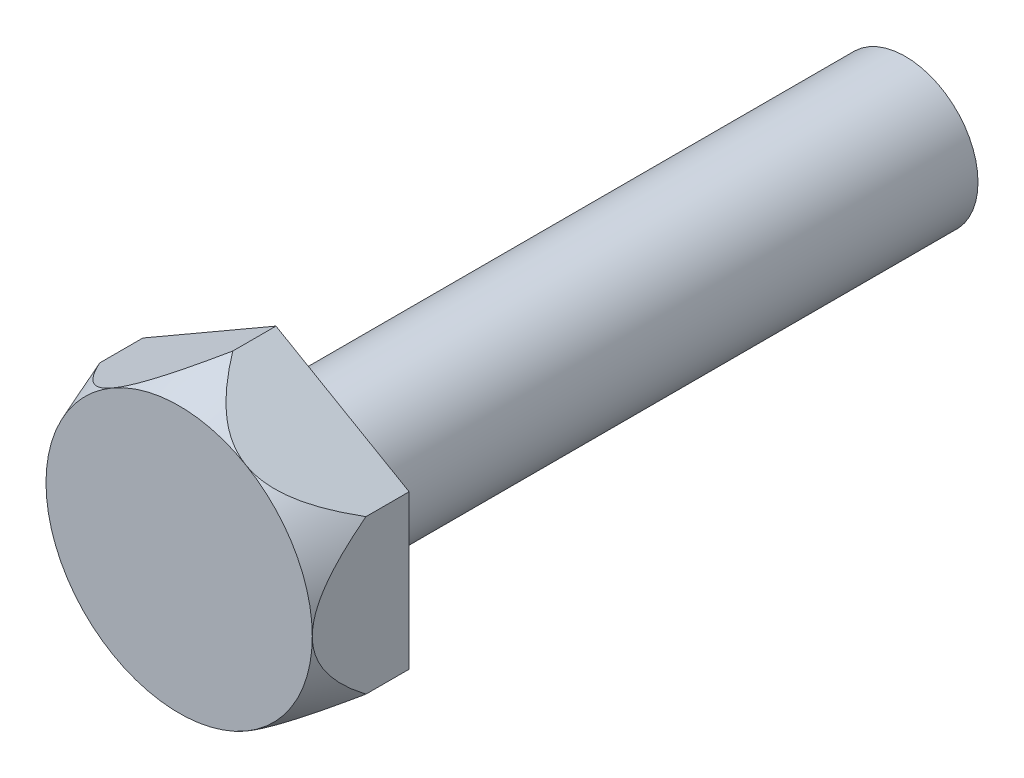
ISO-10303-21;
HEADER;
FILE_DESCRIPTION(('STEP AP214'),'2;1');
FILE_NAME('part.step','',(''),(''),'','','');
FILE_SCHEMA(('AUTOMOTIVE_DESIGN { 1 0 10303 214 1 1 1 1 }'));
ENDSEC;
DATA;
#1=APPLICATION_CONTEXT('core data for automotive mechanical design processes');
#2=APPLICATION_PROTOCOL_DEFINITION('international standard','automotive_design',2000,#1);
#3=PRODUCT_CONTEXT('',#1,'mechanical');
#4=PRODUCT('Part','Part','',(#3));
#5=PRODUCT_RELATED_PRODUCT_CATEGORY('part','',(#4));
#6=PRODUCT_DEFINITION_FORMATION('','',#4);
#7=PRODUCT_DEFINITION_CONTEXT('part definition',#1,'design');
#8=PRODUCT_DEFINITION('design','',#6,#7);
#9=PRODUCT_DEFINITION_SHAPE('','',#8);
#10=(LENGTH_UNIT() NAMED_UNIT(*) SI_UNIT(.MILLI.,.METRE.));
#11=(NAMED_UNIT(*) PLANE_ANGLE_UNIT() SI_UNIT($,.RADIAN.));
#12=(NAMED_UNIT(*) SI_UNIT($,.STERADIAN.) SOLID_ANGLE_UNIT());
#13=UNCERTAINTY_MEASURE_WITH_UNIT(LENGTH_MEASURE(1.E-05),#10,'distance_accuracy_value','');
#14=(GEOMETRIC_REPRESENTATION_CONTEXT(3) GLOBAL_UNCERTAINTY_ASSIGNED_CONTEXT((#13)) GLOBAL_UNIT_ASSIGNED_CONTEXT((#10,
#11,#12)) REPRESENTATION_CONTEXT('',''));
#15=CARTESIAN_POINT('',(0.,0.,0.));
#16=DIRECTION('',(0.,0.,1.));
#17=DIRECTION('',(1.,0.,0.));
#18=AXIS2_PLACEMENT_3D('',#15,#16,#17);
#19=CARTESIAN_POINT('',(0.,3.17542648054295,0.));
#20=DIRECTION('',(0.,0.,1.));
#21=DIRECTION('',(1.,0.,0.));
#22=AXIS2_PLACEMENT_3D('',#19,#20,#21);
#23=PLANE('',#22);
#24=DIRECTION('',(-0.866025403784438,0.5,0.));
#25=VECTOR('',#24,1.);
#26=CARTESIAN_POINT('',(2.75,1.58771324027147,0.));
#27=LINE('',#26,#25);
#28=CARTESIAN_POINT('',(2.75,1.58771324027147,0.));
#29=VERTEX_POINT('',#28);
#30=CARTESIAN_POINT('',(0.,3.17542648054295,0.));
#31=VERTEX_POINT('',#30);
#32=EDGE_CURVE('E114',#29,#31,#27,.T.);
#33=ORIENTED_EDGE('',*,*,#32,.F.);
#34=DIRECTION('',(0.,1.,0.));
#35=VECTOR('',#34,1.);
#36=CARTESIAN_POINT('',(2.75,-1.58771324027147,0.));
#37=LINE('',#36,#35);
#38=CARTESIAN_POINT('',(2.75,-1.58771324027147,0.));
#39=VERTEX_POINT('',#38);
#40=EDGE_CURVE('E261',#39,#29,#37,.T.);
#41=ORIENTED_EDGE('',*,*,#40,.F.);
#42=DIRECTION('',(0.866025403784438,0.5,0.));
#43=VECTOR('',#42,1.);
#44=CARTESIAN_POINT('',(0.,-3.17542648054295,0.));
#45=LINE('',#44,#43);
#46=CARTESIAN_POINT('',(0.,-3.17542648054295,0.));
#47=VERTEX_POINT('',#46);
#48=EDGE_CURVE('E259',#47,#39,#45,.T.);
#49=ORIENTED_EDGE('',*,*,#48,.F.);
#50=DIRECTION('',(0.866025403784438,-0.500000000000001,0.));
#51=VECTOR('',#50,1.);
#52=CARTESIAN_POINT('',(-2.75,-1.58771324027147,0.));
#53=LINE('',#52,#51);
#54=CARTESIAN_POINT('',(-2.75,-1.58771324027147,0.));
#55=VERTEX_POINT('',#54);
#56=EDGE_CURVE('E224',#55,#47,#53,.T.);
#57=ORIENTED_EDGE('',*,*,#56,.F.);
#58=DIRECTION('',(0.,-1.,0.));
#59=VECTOR('',#58,1.);
#60=CARTESIAN_POINT('',(-2.75,1.58771324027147,0.));
#61=LINE('',#60,#59);
#62=CARTESIAN_POINT('',(-2.75,1.58771324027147,0.));
#63=VERTEX_POINT('',#62);
#64=EDGE_CURVE('E267',#63,#55,#61,.T.);
#65=ORIENTED_EDGE('',*,*,#64,.F.);
#66=DIRECTION('',(-0.866025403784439,-0.5,0.));
#67=VECTOR('',#66,1.);
#68=CARTESIAN_POINT('',(0.,3.17542648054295,0.));
#69=LINE('',#68,#67);
#70=EDGE_CURVE('E268',#31,#63,#69,.T.);
#71=ORIENTED_EDGE('',*,*,#70,.F.);
#72=EDGE_LOOP('',(#33,#41,#49,#57,#65,#71));
#73=FACE_BOUND('',#72,.T.);
#74=CARTESIAN_POINT('',(0.,0.,0.));
#75=DIRECTION('',(0.,0.,1.));
#76=DIRECTION('',(1.,0.,0.));
#77=AXIS2_PLACEMENT_3D('',#74,#75,#76);
#78=CIRCLE('',#77,1.5);
#79=CARTESIAN_POINT('',(1.5,0.,0.));
#80=VERTEX_POINT('',#79);
#81=EDGE_CURVE('E12',#80,#80,#78,.F.);
#82=ORIENTED_EDGE('',*,*,#81,.F.);
#83=EDGE_LOOP('',(#82));
#84=FACE_BOUND('',#83,.T.);
#85=ADVANCED_FACE('F32',(#73,#84),#23,.F.);
#86=CARTESIAN_POINT('',(2.75,1.58771324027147,2.));
#87=DIRECTION('',(-0.5,-0.866025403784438,0.));
#88=DIRECTION('',(0.866025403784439,-0.5,0.));
#89=AXIS2_PLACEMENT_3D('',#86,#87,#88);
#90=PLANE('',#89);
#91=CARTESIAN_POINT('',(2.7502,1.58759777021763,0.891425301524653));
#92=CARTESIAN_POINT('',(2.72483006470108,1.60224510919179,0.929582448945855));
#93=CARTESIAN_POINT('',(2.69913335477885,1.61708111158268,0.967449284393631));
#94=CARTESIAN_POINT('',(2.64699514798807,1.6471831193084,1.04250909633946));
#95=CARTESIAN_POINT('',(2.62055345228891,1.66244923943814,1.07970188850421));
#96=CARTESIAN_POINT('',(2.53960450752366,1.70918513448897,1.19063332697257));
#97=CARTESIAN_POINT('',(2.48383960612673,1.74138101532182,1.26316734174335));
#98=CARTESIAN_POINT('',(2.36594902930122,1.80944517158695,1.40634953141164));
#99=CARTESIAN_POINT('',(2.30366274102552,1.84540617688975,1.47682328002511));
#100=CARTESIAN_POINT('',(2.17353357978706,1.9205362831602,1.61025791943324));
#101=CARTESIAN_POINT('',(2.10571002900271,1.95969422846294,1.67324319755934));
#102=CARTESIAN_POINT('',(1.98089614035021,2.03175556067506,1.77341193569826));
#103=CARTESIAN_POINT('',(1.92544181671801,2.06377212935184,1.81310794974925));
#104=CARTESIAN_POINT('',(1.81058167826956,2.13008666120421,1.88310916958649));
#105=CARTESIAN_POINT('',(1.75120455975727,2.16436805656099,1.91347500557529));
#106=CARTESIAN_POINT('',(1.63865889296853,2.22934632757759,1.95785084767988));
#107=CARTESIAN_POINT('',(1.58605175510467,2.25971907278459,1.97371800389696));
#108=CARTESIAN_POINT('',(1.47923620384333,2.32138906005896,1.99492688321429));
#109=CARTESIAN_POINT('',(1.42502856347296,2.35268585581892,2.00027360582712));
#110=CARTESIAN_POINT('',(1.31656477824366,2.41530745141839,1.99970408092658));
#111=CARTESIAN_POINT('',(1.26230871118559,2.44663220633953,1.99376837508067));
#112=CARTESIAN_POINT('',(1.15547805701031,2.50831091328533,1.97142393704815));
#113=CARTESIAN_POINT('',(1.10290430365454,2.5386643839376,1.95501009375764));
#114=CARTESIAN_POINT('',(0.979797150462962,2.60974033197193,1.90519724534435));
#115=CARTESIAN_POINT('',(0.910554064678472,2.64971784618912,1.86762057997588));
#116=CARTESIAN_POINT('',(0.777415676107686,2.72658533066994,1.7805417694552));
#117=CARTESIAN_POINT('',(0.713573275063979,2.76344475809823,1.73093676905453));
#118=CARTESIAN_POINT('',(0.588298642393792,2.835772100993,1.62150854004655));
#119=CARTESIAN_POINT('',(0.527109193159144,2.87109984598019,1.56132241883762));
#120=CARTESIAN_POINT('',(0.409235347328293,2.93915434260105,1.43514951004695));
#121=CARTESIAN_POINT('',(0.352561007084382,2.97187528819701,1.36915042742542));
#122=CARTESIAN_POINT('',(0.244947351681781,3.03400606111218,1.23574606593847));
#123=CARTESIAN_POINT('',(0.19387327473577,3.06349369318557,1.16848379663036));
#124=CARTESIAN_POINT('',(0.0947809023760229,3.12070470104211,1.03157863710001));
#125=CARTESIAN_POINT('',(0.0467486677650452,3.14843612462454,0.961949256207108));
#126=CARTESIAN_POINT('',(-0.000200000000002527,3.17554195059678,0.891425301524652));
#127=B_SPLINE_CURVE_WITH_KNOTS('',3,(#91,#92,#93,#94,#95,#96,#97,#98,#99,#100,#101,#102,#103,
#104,#105,#106,#107,#108,#109,#110,#111,#112,#113,#114,#115,#116,#117,#118,#119,#120,#121,#122,
#123,#124,#125,#126),.UNSPECIFIED.,.F.,.F.,(4,2,2,2,2,2,2,2,2,2,2,2,2,2,2,2,2,4),(0.,
0.144311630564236,0.288662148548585,0.579460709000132,0.88123179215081,1.18199150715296,
1.4074916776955,1.63149388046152,1.81905509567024,2.00652715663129,2.19432283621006,
2.38221019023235,2.64573604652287,2.91160014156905,3.1895917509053,3.4681861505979,
3.73644479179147,4.00336876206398),.UNSPECIFIED.);
#128=CARTESIAN_POINT('',(2.75,1.5877132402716,0.891726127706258));
#129=VERTEX_POINT('',#128);
#130=CARTESIAN_POINT('',(1.375,2.38156986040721,2.));
#131=VERTEX_POINT('',#130);
#132=EDGE_CURVE('E107',#129,#131,#127,.T.);
#133=ORIENTED_EDGE('',*,*,#132,.F.);
#134=DIRECTION('',(0.,0.,-1.));
#135=VECTOR('',#134,1.);
#136=CARTESIAN_POINT('',(2.75,1.58771324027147,2.));
#137=LINE('',#136,#135);
#138=EDGE_CURVE('E56',#129,#29,#137,.T.);
#139=ORIENTED_EDGE('',*,*,#138,.T.);
#140=ORIENTED_EDGE('',*,*,#32,.T.);
#141=DIRECTION('',(0.,0.,-1.));
#142=VECTOR('',#141,1.);
#143=CARTESIAN_POINT('',(0.,3.17542648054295,2.));
#144=LINE('',#143,#142);
#145=CARTESIAN_POINT('',(0.,3.17542648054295,0.89172612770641));
#146=VERTEX_POINT('',#145);
#147=EDGE_CURVE('E130',#146,#31,#144,.T.);
#148=ORIENTED_EDGE('',*,*,#147,.F.);
#149=EDGE_CURVE('E115',#131,#146,#127,.T.);
#150=ORIENTED_EDGE('',*,*,#149,.F.);
#151=EDGE_LOOP('',(#133,#139,#140,#148,#150));
#152=FACE_BOUND('',#151,.T.);
#153=ADVANCED_FACE('F34',(#152),#90,.F.);
#154=CARTESIAN_POINT('',(0.,3.17542648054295,2.));
#155=DIRECTION('',(0.5,-0.866025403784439,0.));
#156=DIRECTION('',(0.866025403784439,0.5,0.));
#157=AXIS2_PLACEMENT_3D('',#154,#155,#156);
#158=PLANE('',#157);
#159=CARTESIAN_POINT('',(0.000199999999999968,3.17554195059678,0.891425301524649));
#160=CARTESIAN_POINT('',(-0.0251699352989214,3.16089461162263,0.92958244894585));
#161=CARTESIAN_POINT('',(-0.0508666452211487,3.14605860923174,0.967449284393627));
#162=CARTESIAN_POINT('',(-0.103004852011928,3.11595660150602,1.04250909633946));
#163=CARTESIAN_POINT('',(-0.129446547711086,3.10069048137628,1.0797018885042));
#164=CARTESIAN_POINT('',(-0.210395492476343,3.05395458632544,1.19063332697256));
#165=CARTESIAN_POINT('',(-0.266160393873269,3.0217587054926,1.26316734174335));
#166=CARTESIAN_POINT('',(-0.384050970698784,2.95369454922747,1.40634953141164));
#167=CARTESIAN_POINT('',(-0.44633725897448,2.91773354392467,1.4768232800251));
#168=CARTESIAN_POINT('',(-0.576466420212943,2.84260343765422,1.61025791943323));
#169=CARTESIAN_POINT('',(-0.644289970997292,2.80344549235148,1.67324319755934));
#170=CARTESIAN_POINT('',(-0.769103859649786,2.73138416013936,1.77341193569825));
#171=CARTESIAN_POINT('',(-0.824558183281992,2.69936759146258,1.81310794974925));
#172=CARTESIAN_POINT('',(-0.939418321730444,2.63305305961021,1.88310916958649));
#173=CARTESIAN_POINT('',(-0.998795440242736,2.59877166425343,1.91347500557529));
#174=CARTESIAN_POINT('',(-1.11134110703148,2.53379339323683,1.95785084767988));
#175=CARTESIAN_POINT('',(-1.16394824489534,2.50342064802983,1.97371800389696));
#176=CARTESIAN_POINT('',(-1.27076379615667,2.44175066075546,1.99492688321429));
#177=CARTESIAN_POINT('',(-1.32497143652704,2.4104538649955,2.00027360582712));
#178=CARTESIAN_POINT('',(-1.43343522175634,2.34783226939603,1.99970408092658));
#179=CARTESIAN_POINT('',(-1.48769128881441,2.31650751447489,1.99376837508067));
#180=CARTESIAN_POINT('',(-1.59452194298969,2.25482880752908,1.97142393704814));
#181=CARTESIAN_POINT('',(-1.64709569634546,2.22447533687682,1.95501009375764));
#182=CARTESIAN_POINT('',(-1.77020284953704,2.15339938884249,1.90519724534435));
#183=CARTESIAN_POINT('',(-1.83944593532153,2.1134218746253,1.86762057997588));
#184=CARTESIAN_POINT('',(-1.97258432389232,2.03655439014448,1.78054176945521));
#185=CARTESIAN_POINT('',(-2.03642672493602,1.99969496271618,1.73093676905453));
#186=CARTESIAN_POINT('',(-2.16170135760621,1.92736761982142,1.62150854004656));
#187=CARTESIAN_POINT('',(-2.22289080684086,1.89203987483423,1.56132241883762));
#188=CARTESIAN_POINT('',(-2.34076465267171,1.82398537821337,1.43514951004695));
#189=CARTESIAN_POINT('',(-2.39743899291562,1.79126443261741,1.36915042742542));
#190=CARTESIAN_POINT('',(-2.50505264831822,1.72913365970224,1.23574606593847));
#191=CARTESIAN_POINT('',(-2.55612672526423,1.69964602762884,1.16848379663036));
#192=CARTESIAN_POINT('',(-2.65521909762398,1.64243501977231,1.03157863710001));
#193=CARTESIAN_POINT('',(-2.70325133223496,1.61470359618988,0.961949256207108));
#194=CARTESIAN_POINT('',(-2.75020000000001,1.58759777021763,0.891425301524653));
#195=B_SPLINE_CURVE_WITH_KNOTS('',3,(#159,#160,#161,#162,#163,#164,#165,#166,#167,#168,#169,
#170,#171,#172,#173,#174,#175,#176,#177,#178,#179,#180,#181,#182,#183,#184,#185,#186,#187,#188,
#189,#190,#191,#192,#193,#194),.UNSPECIFIED.,.F.,.F.,(4,2,2,2,2,2,2,2,2,2,2,2,2,2,2,2,2,4),(0.,
0.144311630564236,0.288662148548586,0.579460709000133,0.881231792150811,1.18199150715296,
1.40749167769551,1.63149388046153,1.81905509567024,2.00652715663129,2.19432283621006,
2.38221019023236,2.64573604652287,2.91160014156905,3.1895917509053,3.46818615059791,
3.73644479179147,4.00336876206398),.UNSPECIFIED.);
#196=CARTESIAN_POINT('',(-1.375,2.38156986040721,2.));
#197=VERTEX_POINT('',#196);
#198=EDGE_CURVE('E121',#146,#197,#195,.T.);
#199=ORIENTED_EDGE('',*,*,#198,.F.);
#200=ORIENTED_EDGE('',*,*,#147,.T.);
#201=ORIENTED_EDGE('',*,*,#70,.T.);
#202=DIRECTION('',(0.,0.,-1.));
#203=VECTOR('',#202,1.);
#204=CARTESIAN_POINT('',(-2.75,1.58771324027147,2.));
#205=LINE('',#204,#203);
#206=CARTESIAN_POINT('',(-2.75,1.5877132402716,0.891726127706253));
#207=VERTEX_POINT('',#206);
#208=EDGE_CURVE('E229',#207,#63,#205,.T.);
#209=ORIENTED_EDGE('',*,*,#208,.F.);
#210=EDGE_CURVE('E131',#197,#207,#195,.T.);
#211=ORIENTED_EDGE('',*,*,#210,.F.);
#212=EDGE_LOOP('',(#199,#200,#201,#209,#211));
#213=FACE_BOUND('',#212,.T.);
#214=ADVANCED_FACE('F184',(#213),#158,.F.);
#215=CARTESIAN_POINT('',(-2.75,1.58771324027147,2.));
#216=DIRECTION('',(1.,0.,0.));
#217=DIRECTION('',(0.,1.,0.));
#218=AXIS2_PLACEMENT_3D('',#215,#216,#217);
#219=PLANE('',#218);
#220=CARTESIAN_POINT('',(-2.75,-3.89015134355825,-3.24667165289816));
#221=CARTESIAN_POINT('',(-2.75,-3.81148641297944,-3.0793665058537));
#222=CARTESIAN_POINT('',(-2.75,-3.73219430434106,-2.91235273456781));
#223=CARTESIAN_POINT('',(-2.75,-3.57204223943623,-2.57904413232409));
#224=CARTESIAN_POINT('',(-2.75,-3.49118201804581,-2.41274942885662));
#225=CARTESIAN_POINT('',(-2.75,-3.32699699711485,-2.07983572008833));
#226=CARTESIAN_POINT('',(-2.75,-3.24365831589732,-1.91322354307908));
#227=CARTESIAN_POINT('',(-2.75,-3.07467896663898,-1.5811911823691));
#228=CARTESIAN_POINT('',(-2.75,-2.98903854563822,-1.41577087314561));
#229=CARTESIAN_POINT('',(-2.75,-2.80402688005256,-1.06591966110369));
#230=CARTESIAN_POINT('',(-2.75,-2.70427465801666,-0.88168909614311));
#231=CARTESIAN_POINT('',(-2.75,-2.49994153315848,-0.515828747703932));
#232=CARTESIAN_POINT('',(-2.75,-2.39535891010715,-0.334199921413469));
#233=CARTESIAN_POINT('',(-2.75,-2.18004388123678,0.0245459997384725));
#234=CARTESIAN_POINT('',(-2.75,-2.06933500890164,0.201677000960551));
#235=CARTESIAN_POINT('',(-2.75,-1.89632370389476,0.462699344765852));
#236=CARTESIAN_POINT('',(-2.75,-1.83751429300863,0.548902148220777));
#237=CARTESIAN_POINT('',(-2.75,-1.71703151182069,0.7192753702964));
#238=CARTESIAN_POINT('',(-2.75,-1.65535859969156,0.803446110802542));
#239=CARTESIAN_POINT('',(-2.75,-1.53156539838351,0.965011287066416));
#240=CARTESIAN_POINT('',(-2.75,-1.46961558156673,1.04253555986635));
#241=CARTESIAN_POINT('',(-2.75,-1.34162548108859,1.19429417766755));
#242=CARTESIAN_POINT('',(-2.75,-1.27558137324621,1.26852533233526));
#243=CARTESIAN_POINT('',(-2.75,-1.13932807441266,1.41118499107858));
#244=CARTESIAN_POINT('',(-2.75,-1.06918824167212,1.47967899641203));
#245=CARTESIAN_POINT('',(-2.75,-0.922719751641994,1.60960918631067));
#246=CARTESIAN_POINT('',(-2.75,-0.846402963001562,1.67105838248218));
#247=CARTESIAN_POINT('',(-2.75,-0.704570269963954,1.77022187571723));
#248=CARTESIAN_POINT('',(-2.75,-0.640620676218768,1.81014203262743));
#249=CARTESIAN_POINT('',(-2.75,-0.50780627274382,1.88084376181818));
#250=CARTESIAN_POINT('',(-2.75,-0.438948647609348,1.91163836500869));
#251=CARTESIAN_POINT('',(-2.75,-0.308634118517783,1.9566429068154));
#252=CARTESIAN_POINT('',(-2.75,-0.247850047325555,1.97275892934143));
#253=CARTESIAN_POINT('',(-2.75,-0.124399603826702,1.99446160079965));
#254=CARTESIAN_POINT('',(-2.75,-0.0617344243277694,2.00005478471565));
#255=CARTESIAN_POINT('',(-2.75,0.0637100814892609,1.99994429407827));
#256=CARTESIAN_POINT('',(-2.75,0.126489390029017,1.99421838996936));
#257=CARTESIAN_POINT('',(-2.75,0.250127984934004,1.9722293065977));
#258=CARTESIAN_POINT('',(-2.75,0.310986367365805,1.95596124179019));
#259=CARTESIAN_POINT('',(-2.75,0.453257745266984,1.90650703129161));
#260=CARTESIAN_POINT('',(-2.75,0.533199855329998,1.86916279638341));
#261=CARTESIAN_POINT('',(-2.75,0.686505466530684,1.78274370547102));
#262=CARTESIAN_POINT('',(-2.75,0.759844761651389,1.7336279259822));
#263=CARTESIAN_POINT('',(-2.75,0.919678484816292,1.61329678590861));
#264=CARTESIAN_POINT('',(-2.75,1.00434668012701,1.53970042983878));
#265=CARTESIAN_POINT('',(-2.75,1.16635662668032,1.38475379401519));
#266=CARTESIAN_POINT('',(-2.75,1.24368302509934,1.30338794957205));
#267=CARTESIAN_POINT('',(-2.75,1.39359875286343,1.13457193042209));
#268=CARTESIAN_POINT('',(-2.75,1.46611437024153,1.04705696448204));
#269=CARTESIAN_POINT('',(-2.75,1.57145731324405,0.913201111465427));
#270=CARTESIAN_POINT('',(-2.75,1.6059838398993,0.868174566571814));
#271=CARTESIAN_POINT('',(-2.75,1.67403535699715,0.77737207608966));
#272=CARTESIAN_POINT('',(-2.75,1.7075603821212,0.731596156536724));
#273=CARTESIAN_POINT('',(-2.75,1.81738752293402,0.578584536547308));
#274=CARTESIAN_POINT('',(-2.75,1.89175745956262,0.469961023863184));
#275=CARTESIAN_POINT('',(-2.75,2.03683151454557,0.250283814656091));
#276=CARTESIAN_POINT('',(-2.75,2.10753484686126,0.139229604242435));
#277=CARTESIAN_POINT('',(-2.75,2.24606633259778,-0.0847545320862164));
#278=CARTESIAN_POINT('',(-2.75,2.3138925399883,-0.197685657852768));
#279=CARTESIAN_POINT('',(-2.75,2.44717542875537,-0.424940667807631));
#280=CARTESIAN_POINT('',(-2.75,2.51263197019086,-0.539264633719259));
#281=CARTESIAN_POINT('',(-2.75,2.70655363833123,-0.884681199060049));
#282=CARTESIAN_POINT('',(-2.75,2.83208589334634,-1.11741919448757));
#283=CARTESIAN_POINT('',(-2.75,3.07760588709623,-1.58565694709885));
#284=CARTESIAN_POINT('',(-2.75,3.1975957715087,-1.82115559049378));
#285=CARTESIAN_POINT('',(-2.75,3.41948074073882,-2.2660707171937));
#286=CARTESIAN_POINT('',(-2.75,3.52183151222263,-2.47526061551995));
#287=CARTESIAN_POINT('',(-2.75,3.72404739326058,-2.89486561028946));
#288=CARTESIAN_POINT('',(-2.75,3.82391221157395,-3.10528084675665));
#289=CARTESIAN_POINT('',(-2.75,4.02093212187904,-3.52554674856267));
#290=CARTESIAN_POINT('',(-2.75,4.1181014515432,-3.73539075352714));
#291=CARTESIAN_POINT('',(-2.75,4.31078607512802,-4.15579513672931));
#292=CARTESIAN_POINT('',(-2.75,4.40630164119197,-4.36635539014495));
#293=CARTESIAN_POINT('',(-2.75,4.50116777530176,-4.57720448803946));
#294=B_SPLINE_CURVE_WITH_KNOTS('',3,(#220,#221,#222,#223,#224,#225,#226,#227,#228,#229,#230,
#231,#232,#233,#234,#235,#236,#237,#238,#239,#240,#241,#242,#243,#244,#245,#246,#247,#248,#249,
#250,#251,#252,#253,#254,#255,#256,#257,#258,#259,#260,#261,#262,#263,#264,#265,#266,#267,#268,
#269,#270,#271,#272,#273,#274,#275,#276,#277,#278,#279,#280,#281,#282,#283,#284,#285,#286,#287,
#288,#289,#290,#291,#292,#293),.UNSPECIFIED.,.F.,.F.,(4,2,2,2,2,2,2,2,2,2,2,2,2,2,2,2,2,2,2,2,2,
2,2,2,2,2,2,2,2,2,2,2,2,2,2,2,4),(0.,0.554631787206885,1.10935817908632,1.66822103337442,
2.22702414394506,2.85547628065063,3.48415397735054,4.11056489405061,4.42357918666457,
4.73654356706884,5.0341498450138,5.33203841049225,5.62585084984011,5.91911157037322,
6.14476145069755,6.37008754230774,6.55795255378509,6.74570085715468,6.93381824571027,
7.12202287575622,7.38520988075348,7.64932547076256,7.98506762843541,8.32149708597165,
8.66225327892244,8.83246505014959,9.002670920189,9.39748872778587,9.79239082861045,
10.1875559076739,10.5827442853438,11.3759239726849,12.168793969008,12.8674325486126,
13.5661525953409,14.2598939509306,14.9535200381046),.UNSPECIFIED.);
#295=CARTESIAN_POINT('',(-2.75,0.,2.));
#296=VERTEX_POINT('',#295);
#297=EDGE_CURVE('E178',#207,#296,#294,.F.);
#298=ORIENTED_EDGE('',*,*,#297,.F.);
#299=ORIENTED_EDGE('',*,*,#208,.T.);
#300=ORIENTED_EDGE('',*,*,#64,.T.);
#301=DIRECTION('',(0.,0.,-1.));
#302=VECTOR('',#301,1.);
#303=CARTESIAN_POINT('',(-2.75,-1.58771324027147,2.));
#304=LINE('',#303,#302);
#305=CARTESIAN_POINT('',(-2.75,-1.58771324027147,0.891726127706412));
#306=VERTEX_POINT('',#305);
#307=EDGE_CURVE('E226',#306,#55,#304,.T.);
#308=ORIENTED_EDGE('',*,*,#307,.F.);
#309=EDGE_CURVE('E173',#296,#306,#294,.F.);
#310=ORIENTED_EDGE('',*,*,#309,.F.);
#311=EDGE_LOOP('',(#298,#299,#300,#308,#310));
#312=FACE_BOUND('',#311,.T.);
#313=ADVANCED_FACE('F180',(#312),#219,.F.);
#314=CARTESIAN_POINT('',(-2.75,-1.58771324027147,2.));
#315=DIRECTION('',(0.500000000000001,0.866025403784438,0.));
#316=DIRECTION('',(-0.866025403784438,0.500000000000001,0.));
#317=AXIS2_PLACEMENT_3D('',#314,#315,#316);
#318=PLANE('',#317);
#319=CARTESIAN_POINT('',(-2.7502,-1.58759777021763,0.89142530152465));
#320=CARTESIAN_POINT('',(-2.72483006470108,-1.60224510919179,0.929582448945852));
#321=CARTESIAN_POINT('',(-2.69913335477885,-1.61708111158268,0.967449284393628));
#322=CARTESIAN_POINT('',(-2.64699514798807,-1.6471831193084,1.04250909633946));
#323=CARTESIAN_POINT('',(-2.62055345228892,-1.66244923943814,1.0797018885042));
#324=CARTESIAN_POINT('',(-2.53960450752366,-1.70918513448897,1.19063332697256));
#325=CARTESIAN_POINT('',(-2.48383960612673,-1.74138101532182,1.26316734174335));
#326=CARTESIAN_POINT('',(-2.36594902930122,-1.80944517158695,1.40634953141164));
#327=CARTESIAN_POINT('',(-2.30366274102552,-1.84540617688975,1.4768232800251));
#328=CARTESIAN_POINT('',(-2.17353357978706,-1.9205362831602,1.61025791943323));
#329=CARTESIAN_POINT('',(-2.10571002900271,-1.95969422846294,1.67324319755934));
#330=CARTESIAN_POINT('',(-1.98089614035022,-2.03175556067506,1.77341193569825));
#331=CARTESIAN_POINT('',(-1.92544181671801,-2.06377212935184,1.81310794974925));
#332=CARTESIAN_POINT('',(-1.81058167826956,-2.13008666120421,1.88310916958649));
#333=CARTESIAN_POINT('',(-1.75120455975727,-2.16436805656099,1.91347500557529));
#334=CARTESIAN_POINT('',(-1.63865889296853,-2.22934632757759,1.95785084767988));
#335=CARTESIAN_POINT('',(-1.58605175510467,-2.25971907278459,1.97371800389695));
#336=CARTESIAN_POINT('',(-1.47923620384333,-2.32138906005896,1.99492688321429));
#337=CARTESIAN_POINT('',(-1.42502856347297,-2.35268585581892,2.00027360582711));
#338=CARTESIAN_POINT('',(-1.31656477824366,-2.41530745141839,1.99970408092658));
#339=CARTESIAN_POINT('',(-1.2623087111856,-2.44663220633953,1.99376837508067));
#340=CARTESIAN_POINT('',(-1.15547805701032,-2.50831091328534,1.97142393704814));
#341=CARTESIAN_POINT('',(-1.10290430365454,-2.5386643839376,1.95501009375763));
#342=CARTESIAN_POINT('',(-0.979797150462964,-2.60974033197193,1.90519724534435));
#343=CARTESIAN_POINT('',(-0.910554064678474,-2.64971784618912,1.86762057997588));
#344=CARTESIAN_POINT('',(-0.777415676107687,-2.72658533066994,1.7805417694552));
#345=CARTESIAN_POINT('',(-0.713573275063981,-2.76344475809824,1.73093676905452));
#346=CARTESIAN_POINT('',(-0.588298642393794,-2.835772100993,1.62150854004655));
#347=CARTESIAN_POINT('',(-0.527109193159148,-2.87109984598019,1.56132241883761));
#348=CARTESIAN_POINT('',(-0.409235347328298,-2.93915434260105,1.43514951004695));
#349=CARTESIAN_POINT('',(-0.352561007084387,-2.97187528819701,1.36915042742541));
#350=CARTESIAN_POINT('',(-0.244947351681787,-3.03400606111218,1.23574606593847));
#351=CARTESIAN_POINT('',(-0.193873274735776,-3.06349369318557,1.16848379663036));
#352=CARTESIAN_POINT('',(-0.0947809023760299,-3.12070470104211,1.03157863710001));
#353=CARTESIAN_POINT('',(-0.0467486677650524,-3.14843612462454,0.961949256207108));
#354=CARTESIAN_POINT('',(0.000199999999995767,-3.17554195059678,0.891425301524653));
#355=B_SPLINE_CURVE_WITH_KNOTS('',3,(#319,#320,#321,#322,#323,#324,#325,#326,#327,#328,#329,
#330,#331,#332,#333,#334,#335,#336,#337,#338,#339,#340,#341,#342,#343,#344,#345,#346,#347,#348,
#349,#350,#351,#352,#353,#354),.UNSPECIFIED.,.F.,.F.,(4,2,2,2,2,2,2,2,2,2,2,2,2,2,2,2,2,4),(0.,
0.144311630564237,0.288662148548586,0.579460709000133,0.881231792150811,1.18199150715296,
1.4074916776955,1.63149388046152,1.81905509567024,2.00652715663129,2.19432283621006,
2.38221019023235,2.64573604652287,2.91160014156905,3.1895917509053,3.4681861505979,
3.73644479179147,4.00336876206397),.UNSPECIFIED.);
#356=CARTESIAN_POINT('',(-1.375,-2.38156986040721,2.));
#357=VERTEX_POINT('',#356);
#358=EDGE_CURVE('E179',#306,#357,#355,.T.);
#359=ORIENTED_EDGE('',*,*,#358,.F.);
#360=ORIENTED_EDGE('',*,*,#307,.T.);
#361=ORIENTED_EDGE('',*,*,#56,.T.);
#362=DIRECTION('',(0.,0.,-1.));
#363=VECTOR('',#362,1.);
#364=CARTESIAN_POINT('',(0.,-3.17542648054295,2.));
#365=LINE('',#364,#363);
#366=CARTESIAN_POINT('',(0.,-3.17542648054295,0.89172612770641));
#367=VERTEX_POINT('',#366);
#368=EDGE_CURVE('E216',#367,#47,#365,.T.);
#369=ORIENTED_EDGE('',*,*,#368,.F.);
#370=EDGE_CURVE('E168',#357,#367,#355,.T.);
#371=ORIENTED_EDGE('',*,*,#370,.F.);
#372=EDGE_LOOP('',(#359,#360,#361,#369,#371));
#373=FACE_BOUND('',#372,.T.);
#374=ADVANCED_FACE('F183',(#373),#318,.F.);
#375=CARTESIAN_POINT('',(0.,-3.17542648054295,2.));
#376=DIRECTION('',(-0.5,0.866025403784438,0.));
#377=DIRECTION('',(-0.866025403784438,-0.5,0.));
#378=AXIS2_PLACEMENT_3D('',#375,#376,#377);
#379=PLANE('',#378);
#380=CARTESIAN_POINT('',(-0.000200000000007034,-3.17554195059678,0.891425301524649));
#381=CARTESIAN_POINT('',(0.0251699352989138,-3.16089461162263,0.929582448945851));
#382=CARTESIAN_POINT('',(0.050866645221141,-3.14605860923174,0.967449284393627));
#383=CARTESIAN_POINT('',(0.103004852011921,-3.11595660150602,1.04250909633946));
#384=CARTESIAN_POINT('',(0.129446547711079,-3.10069048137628,1.0797018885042));
#385=CARTESIAN_POINT('',(0.210395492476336,-3.05395458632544,1.19063332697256));
#386=CARTESIAN_POINT('',(0.266160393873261,-3.0217587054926,1.26316734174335));
#387=CARTESIAN_POINT('',(0.384050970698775,-2.95369454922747,1.40634953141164));
#388=CARTESIAN_POINT('',(0.446337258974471,-2.91773354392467,1.4768232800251));
#389=CARTESIAN_POINT('',(0.576466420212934,-2.84260343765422,1.61025791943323));
#390=CARTESIAN_POINT('',(0.644289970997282,-2.80344549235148,1.67324319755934));
#391=CARTESIAN_POINT('',(0.769103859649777,-2.73138416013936,1.77341193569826));
#392=CARTESIAN_POINT('',(0.824558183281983,-2.69936759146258,1.81310794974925));
#393=CARTESIAN_POINT('',(0.939418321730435,-2.63305305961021,1.8831091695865));
#394=CARTESIAN_POINT('',(0.998795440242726,-2.59877166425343,1.9134750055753));
#395=CARTESIAN_POINT('',(1.11134110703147,-2.53379339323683,1.95785084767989));
#396=CARTESIAN_POINT('',(1.16394824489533,-2.50342064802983,1.97371800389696));
#397=CARTESIAN_POINT('',(1.27076379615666,-2.44175066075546,1.9949268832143));
#398=CARTESIAN_POINT('',(1.32497143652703,-2.4104538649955,2.00027360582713));
#399=CARTESIAN_POINT('',(1.43343522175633,-2.34783226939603,1.99970408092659));
#400=CARTESIAN_POINT('',(1.4876912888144,-2.31650751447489,1.99376837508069));
#401=CARTESIAN_POINT('',(1.59452194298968,-2.25482880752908,1.97142393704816));
#402=CARTESIAN_POINT('',(1.64709569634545,-2.22447533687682,1.95501009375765));
#403=CARTESIAN_POINT('',(1.77020284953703,-2.15339938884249,1.90519724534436));
#404=CARTESIAN_POINT('',(1.83944593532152,-2.1134218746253,1.8676205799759));
#405=CARTESIAN_POINT('',(1.9725843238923,-2.03655439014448,1.78054176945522));
#406=CARTESIAN_POINT('',(2.03642672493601,-1.99969496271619,1.73093676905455));
#407=CARTESIAN_POINT('',(2.1617013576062,-1.92736761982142,1.62150854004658));
#408=CARTESIAN_POINT('',(2.22289080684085,-1.89203987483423,1.56132241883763));
#409=CARTESIAN_POINT('',(2.3407646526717,-1.82398537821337,1.43514951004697));
#410=CARTESIAN_POINT('',(2.39743899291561,-1.79126443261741,1.36915042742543));
#411=CARTESIAN_POINT('',(2.50505264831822,-1.72913365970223,1.23574606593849));
#412=CARTESIAN_POINT('',(2.55612672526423,-1.69964602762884,1.16848379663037));
#413=CARTESIAN_POINT('',(2.65521909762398,-1.6424350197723,1.03157863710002));
#414=CARTESIAN_POINT('',(2.70325133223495,-1.61470359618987,0.961949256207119));
#415=CARTESIAN_POINT('',(2.7502,-1.58759777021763,0.891425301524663));
#416=B_SPLINE_CURVE_WITH_KNOTS('',3,(#380,#381,#382,#383,#384,#385,#386,#387,#388,#389,#390,
#391,#392,#393,#394,#395,#396,#397,#398,#399,#400,#401,#402,#403,#404,#405,#406,#407,#408,#409,
#410,#411,#412,#413,#414,#415),.UNSPECIFIED.,.F.,.F.,(4,2,2,2,2,2,2,2,2,2,2,2,2,2,2,2,2,4),(0.,
0.144311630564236,0.288662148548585,0.579460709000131,0.88123179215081,1.18199150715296,
1.40749167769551,1.63149388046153,1.81905509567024,2.00652715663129,2.19432283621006,
2.38221019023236,2.64573604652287,2.91160014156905,3.1895917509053,3.46818615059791,
3.73644479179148,4.00336876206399),.UNSPECIFIED.);
#417=CARTESIAN_POINT('',(1.375,-2.38156986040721,2.));
#418=VERTEX_POINT('',#417);
#419=EDGE_CURVE('E213',#367,#418,#416,.T.);
#420=ORIENTED_EDGE('',*,*,#419,.F.);
#421=ORIENTED_EDGE('',*,*,#368,.T.);
#422=ORIENTED_EDGE('',*,*,#48,.T.);
#423=DIRECTION('',(0.,0.,-1.));
#424=VECTOR('',#423,1.);
#425=CARTESIAN_POINT('',(2.75,-1.58771324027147,2.));
#426=LINE('',#425,#424);
#427=CARTESIAN_POINT('',(2.75,-1.58771324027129,0.891726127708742));
#428=VERTEX_POINT('',#427);
#429=EDGE_CURVE('E227',#428,#39,#426,.T.);
#430=ORIENTED_EDGE('',*,*,#429,.F.);
#431=EDGE_CURVE('E162',#418,#428,#416,.T.);
#432=ORIENTED_EDGE('',*,*,#431,.F.);
#433=EDGE_LOOP('',(#420,#421,#422,#430,#432));
#434=FACE_BOUND('',#433,.T.);
#435=ADVANCED_FACE('F202',(#434),#379,.F.);
#436=CARTESIAN_POINT('',(2.75,-1.58771324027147,2.));
#437=DIRECTION('',(-1.,0.,0.));
#438=DIRECTION('',(0.,0.,1.));
#439=AXIS2_PLACEMENT_3D('',#436,#437,#438);
#440=PLANE('',#439);
#441=CARTESIAN_POINT('',(2.75,-3.89015132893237,-3.2466716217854));
#442=CARTESIAN_POINT('',(2.75,-3.81148639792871,-3.07936647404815));
#443=CARTESIAN_POINT('',(2.75,-3.73219428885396,-2.91235270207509));
#444=CARTESIAN_POINT('',(2.75,-3.57204222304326,-2.57904409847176));
#445=CARTESIAN_POINT('',(2.75,-3.49118200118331,-2.41274939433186));
#446=CARTESIAN_POINT('',(2.75,-3.3269969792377,-2.07983568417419));
#447=CARTESIAN_POINT('',(2.75,-3.24365829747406,-1.91322350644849));
#448=CARTESIAN_POINT('',(2.75,-3.07467894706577,-1.58119114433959));
#449=CARTESIAN_POINT('',(2.75,-2.98903852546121,-1.41577083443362));
#450=CARTESIAN_POINT('',(2.75,-2.8040268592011,-1.06591962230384));
#451=CARTESIAN_POINT('',(2.75,-2.70427463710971,-0.881689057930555));
#452=CARTESIAN_POINT('',(2.75,-2.49994151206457,-0.515828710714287));
#453=CARTESIAN_POINT('',(2.75,-2.39535888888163,-0.33419988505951));
#454=CARTESIAN_POINT('',(2.75,-2.18004385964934,0.0245460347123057));
#455=CARTESIAN_POINT('',(2.75,-2.06933498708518,0.201677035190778));
#456=CARTESIAN_POINT('',(2.75,-1.89632368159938,0.462699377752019));
#457=CARTESIAN_POINT('',(2.75,-1.83751427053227,0.548902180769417));
#458=CARTESIAN_POINT('',(2.75,-1.71703148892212,0.719275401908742));
#459=CARTESIAN_POINT('',(2.75,-1.65535857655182,0.80344614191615));
#460=CARTESIAN_POINT('',(2.75,-1.53156537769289,0.965011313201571));
#461=CARTESIAN_POINT('',(2.75,-1.46961556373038,1.04253558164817));
#462=CARTESIAN_POINT('',(2.75,-1.34162546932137,1.19429419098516));
#463=CARTESIAN_POINT('',(2.75,-1.27558136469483,1.26852534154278));
#464=CARTESIAN_POINT('',(2.75,-1.13932807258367,1.41118499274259));
#465=CARTESIAN_POINT('',(2.75,-1.06918824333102,1.47967899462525));
#466=CARTESIAN_POINT('',(2.75,-0.922719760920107,1.60960917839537));
#467=CARTESIAN_POINT('',(2.75,-0.846402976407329,1.67105837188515));
#468=CARTESIAN_POINT('',(2.75,-0.704570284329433,1.77022186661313));
#469=CARTESIAN_POINT('',(2.75,-0.640620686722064,1.81014202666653));
#470=CARTESIAN_POINT('',(2.75,-0.507806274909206,1.88084376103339));
#471=CARTESIAN_POINT('',(2.75,-0.438948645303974,1.91163836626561));
#472=CARTESIAN_POINT('',(2.75,-0.308634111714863,1.95664290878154));
#473=CARTESIAN_POINT('',(2.75,-0.247850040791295,1.97275893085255));
#474=CARTESIAN_POINT('',(2.75,-0.124399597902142,1.99446160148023));
#475=CARTESIAN_POINT('',(2.75,-0.0617344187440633,2.00005478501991));
#476=CARTESIAN_POINT('',(2.75,0.0637100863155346,1.99994429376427));
#477=CARTESIAN_POINT('',(2.75,0.126489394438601,1.9942183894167));
#478=CARTESIAN_POINT('',(2.75,0.250127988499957,1.97222930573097));
#479=CARTESIAN_POINT('',(2.75,0.310986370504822,1.95596124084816));
#480=CARTESIAN_POINT('',(2.75,0.453257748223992,1.90650703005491));
#481=CARTESIAN_POINT('',(2.75,0.533199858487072,1.86916279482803));
#482=CARTESIAN_POINT('',(2.75,0.686505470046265,1.78274370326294));
#483=CARTESIAN_POINT('',(2.75,0.759844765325,1.73362792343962));
#484=CARTESIAN_POINT('',(2.75,0.919678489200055,1.6132967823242));
#485=CARTESIAN_POINT('',(2.75,1.00434668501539,1.53970042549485));
#486=CARTESIAN_POINT('',(2.75,1.16635663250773,1.38475378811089));
#487=CARTESIAN_POINT('',(2.75,1.24368303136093,1.30338794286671));
#488=CARTESIAN_POINT('',(2.75,1.39359875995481,1.13457192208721));
#489=CARTESIAN_POINT('',(2.75,1.466114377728,1.04705695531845));
#490=CARTESIAN_POINT('',(2.75,1.5714573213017,0.913201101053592));
#491=CARTESIAN_POINT('',(2.75,1.60598384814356,0.868174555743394));
#492=CARTESIAN_POINT('',(2.75,1.67403536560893,0.777372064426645));
#493=CARTESIAN_POINT('',(2.75,1.70756039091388,0.731596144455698));
#494=CARTESIAN_POINT('',(2.75,1.81738753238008,0.578584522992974));
#495=CARTESIAN_POINT('',(2.75,1.89175746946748,0.469961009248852));
#496=CARTESIAN_POINT('',(2.75,2.03683152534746,0.250283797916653));
#497=CARTESIAN_POINT('',(2.75,2.10753485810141,0.139229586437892));
#498=CARTESIAN_POINT('',(2.75,2.24606634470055,-0.0847545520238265));
#499=CARTESIAN_POINT('',(2.75,2.31389255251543,-0.197685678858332));
#500=CARTESIAN_POINT('',(2.75,2.4471754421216,-0.424940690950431));
#501=CARTESIAN_POINT('',(2.75,2.51263198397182,-0.53926465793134));
#502=CARTESIAN_POINT('',(2.75,2.70655365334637,-0.884681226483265));
#503=CARTESIAN_POINT('',(2.75,2.83208590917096,-1.1174192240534));
#504=CARTESIAN_POINT('',(2.75,3.07760590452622,-1.58565698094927));
#505=CARTESIAN_POINT('',(2.75,3.19759578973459,-1.82115562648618));
#506=CARTESIAN_POINT('',(2.75,3.41948076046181,-2.26607075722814));
#507=CARTESIAN_POINT('',(2.75,3.52183153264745,-2.47526065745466));
#508=CARTESIAN_POINT('',(2.75,3.72404741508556,-2.89486565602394));
#509=CARTESIAN_POINT('',(2.75,3.82391223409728,-3.10528089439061));
#510=CARTESIAN_POINT('',(2.75,4.02093214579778,-3.52554679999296));
#511=CARTESIAN_POINT('',(2.75,4.1181014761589,-3.73539080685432));
#512=CARTESIAN_POINT('',(2.75,4.31078610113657,-4.15579519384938));
#513=CARTESIAN_POINT('',(2.75,4.4063016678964,-4.36635544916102));
#514=CARTESIAN_POINT('',(2.75,4.50116780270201,-4.57720454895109));
#515=B_SPLINE_CURVE_WITH_KNOTS('',3,(#441,#442,#443,#444,#445,#446,#447,#448,#449,#450,#451,
#452,#453,#454,#455,#456,#457,#458,#459,#460,#461,#462,#463,#464,#465,#466,#467,#468,#469,#470,
#471,#472,#473,#474,#475,#476,#477,#478,#479,#480,#481,#482,#483,#484,#485,#486,#487,#488,#489,
#490,#491,#492,#493,#494,#495,#496,#497,#498,#499,#500,#501,#502,#503,#504,#505,#506,#507,#508,
#509,#510,#511,#512,#513,#514),.UNSPECIFIED.,.F.,.F.,(4,2,2,2,2,2,2,2,2,2,2,2,2,2,2,2,2,2,2,2,2,
2,2,2,2,2,2,2,2,2,2,2,2,2,2,2,4),(0.,0.554631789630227,1.10935818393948,1.66822104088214,
2.22702415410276,2.85547628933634,3.48415398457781,4.11056489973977,4.42357919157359,
4.73654357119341,5.03414983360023,5.33203838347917,5.62585080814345,5.91911151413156,
6.14476140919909,6.37008751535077,6.55795252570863,6.74570082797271,6.93381821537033,
7.12202284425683,7.38520985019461,7.64932544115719,7.98506760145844,8.32149706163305,
8.66225325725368,8.83246502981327,9.00267090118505,9.39748871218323,9.79239081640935,
10.1875558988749,10.5827442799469,11.3759239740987,12.1687939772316,12.8674325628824,
13.5661526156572,14.2598939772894,14.9535200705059),.UNSPECIFIED.);
#516=CARTESIAN_POINT('',(2.75,0.,2.));
#517=VERTEX_POINT('',#516);
#518=EDGE_CURVE('E258',#428,#517,#515,.T.);
#519=ORIENTED_EDGE('',*,*,#518,.F.);
#520=ORIENTED_EDGE('',*,*,#429,.T.);
#521=ORIENTED_EDGE('',*,*,#40,.T.);
#522=ORIENTED_EDGE('',*,*,#138,.F.);
#523=EDGE_CURVE('E112',#517,#129,#515,.T.);
#524=ORIENTED_EDGE('',*,*,#523,.F.);
#525=EDGE_LOOP('',(#519,#520,#521,#522,#524));
#526=FACE_BOUND('',#525,.T.);
#527=ADVANCED_FACE('F199',(#526),#440,.F.);
#528=CARTESIAN_POINT('',(0.,0.,2.));
#529=DIRECTION('',(0.,0.,-1.));
#530=DIRECTION('',(1.,0.,0.));
#531=AXIS2_PLACEMENT_3D('',#528,#529,#530);
#532=CONICAL_SURFACE('',#531,2.75,0.366519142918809);
#533=ORIENTED_EDGE('',*,*,#431,.T.);
#534=ORIENTED_EDGE('',*,*,#518,.T.);
#535=CARTESIAN_POINT('',(0.,0.,2.));
#536=DIRECTION('',(0.,0.,1.));
#537=DIRECTION('',(1.,0.,0.));
#538=AXIS2_PLACEMENT_3D('',#535,#536,#537);
#539=CIRCLE('',#538,2.75);
#540=EDGE_CURVE('E48',#418,#517,#539,.T.);
#541=ORIENTED_EDGE('',*,*,#540,.F.);
#542=EDGE_LOOP('',(#533,#534,#541));
#543=FACE_BOUND('',#542,.T.);
#544=ADVANCED_FACE('F147',(#543),#532,.T.);
#545=ORIENTED_EDGE('',*,*,#370,.T.);
#546=ORIENTED_EDGE('',*,*,#419,.T.);
#547=EDGE_CURVE('E235',#357,#418,#539,.T.);
#548=ORIENTED_EDGE('',*,*,#547,.F.);
#549=EDGE_LOOP('',(#545,#546,#548));
#550=FACE_BOUND('',#549,.T.);
#551=ADVANCED_FACE('F247',(#550),#532,.T.);
#552=ORIENTED_EDGE('',*,*,#309,.T.);
#553=ORIENTED_EDGE('',*,*,#358,.T.);
#554=EDGE_CURVE('E236',#296,#357,#539,.T.);
#555=ORIENTED_EDGE('',*,*,#554,.F.);
#556=EDGE_LOOP('',(#552,#553,#555));
#557=FACE_BOUND('',#556,.T.);
#558=ADVANCED_FACE('F246',(#557),#532,.T.);
#559=ORIENTED_EDGE('',*,*,#210,.T.);
#560=ORIENTED_EDGE('',*,*,#297,.T.);
#561=EDGE_CURVE('E125',#197,#296,#539,.T.);
#562=ORIENTED_EDGE('',*,*,#561,.F.);
#563=EDGE_LOOP('',(#559,#560,#562));
#564=FACE_BOUND('',#563,.T.);
#565=ADVANCED_FACE('F253',(#564),#532,.T.);
#566=ORIENTED_EDGE('',*,*,#149,.T.);
#567=ORIENTED_EDGE('',*,*,#198,.T.);
#568=EDGE_CURVE('E41',#131,#197,#539,.T.);
#569=ORIENTED_EDGE('',*,*,#568,.F.);
#570=EDGE_LOOP('',(#566,#567,#569));
#571=FACE_BOUND('',#570,.T.);
#572=ADVANCED_FACE('F119',(#571),#532,.T.);
#573=ORIENTED_EDGE('',*,*,#132,.T.);
#574=CARTESIAN_POINT('',(0.,0.,2.));
#575=DIRECTION('',(0.,0.,1.));
#576=DIRECTION('',(1.,0.,0.));
#577=AXIS2_PLACEMENT_3D('',#574,#575,#576);
#578=CIRCLE('',#577,2.75);
#579=EDGE_CURVE('E110',#517,#131,#578,.T.);
#580=ORIENTED_EDGE('',*,*,#579,.F.);
#581=ORIENTED_EDGE('',*,*,#523,.T.);
#582=EDGE_LOOP('',(#573,#580,#581));
#583=FACE_BOUND('',#582,.T.);
#584=ADVANCED_FACE('F109',(#583),#532,.T.);
#585=CARTESIAN_POINT('',(0.,3.17542648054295,2.));
#586=DIRECTION('',(0.,0.,1.));
#587=DIRECTION('',(1.,0.,0.));
#588=AXIS2_PLACEMENT_3D('',#585,#586,#587);
#589=PLANE('',#588);
#590=ORIENTED_EDGE('',*,*,#540,.T.);
#591=ORIENTED_EDGE('',*,*,#579,.T.);
#592=ORIENTED_EDGE('',*,*,#568,.T.);
#593=ORIENTED_EDGE('',*,*,#561,.T.);
#594=ORIENTED_EDGE('',*,*,#554,.T.);
#595=ORIENTED_EDGE('',*,*,#547,.T.);
#596=EDGE_LOOP('',(#590,#591,#592,#593,#594,#595));
#597=FACE_BOUND('',#596,.T.);
#598=ADVANCED_FACE('F126',(#597),#589,.T.);
#599=CARTESIAN_POINT('',(0.,0.,-13.));
#600=DIRECTION('',(0.,0.,1.));
#601=DIRECTION('',(1.,0.,0.));
#602=AXIS2_PLACEMENT_3D('',#599,#600,#601);
#603=CYLINDRICAL_SURFACE('',#602,1.5);
#604=CARTESIAN_POINT('',(0.,0.,-13.));
#605=DIRECTION('',(0.,0.,-1.));
#606=DIRECTION('',(-1.,0.,0.));
#607=AXIS2_PLACEMENT_3D('',#604,#605,#606);
#608=CIRCLE('',#607,1.5);
#609=CARTESIAN_POINT('',(1.5,0.,-13.));
#610=VERTEX_POINT('',#609);
#611=EDGE_CURVE('E127',#610,#610,#608,.T.);
#612=CARTESIAN_POINT('',(1.5,0.,-13.));
#613=CARTESIAN_POINT('',(1.5,0.,-12.8645833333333));
#614=CARTESIAN_POINT('',(1.5,0.,-12.7291666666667));
#615=CARTESIAN_POINT('',(1.5,0.,-12.4583333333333));
#616=CARTESIAN_POINT('',(1.5,0.,-12.3229166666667));
#617=CARTESIAN_POINT('',(1.5,0.,-12.0520833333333));
#618=CARTESIAN_POINT('',(1.5,0.,-11.9166666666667));
#619=CARTESIAN_POINT('',(1.5,0.,-11.6458333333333));
#620=CARTESIAN_POINT('',(1.5,0.,-11.5104166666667));
#621=CARTESIAN_POINT('',(1.5,0.,-11.2395833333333));
#622=CARTESIAN_POINT('',(1.5,0.,-11.1041666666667));
#623=CARTESIAN_POINT('',(1.5,0.,-10.8333333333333));
#624=CARTESIAN_POINT('',(1.5,0.,-10.6979166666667));
#625=CARTESIAN_POINT('',(1.5,0.,-10.4270833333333));
#626=CARTESIAN_POINT('',(1.5,0.,-10.2916666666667));
#627=CARTESIAN_POINT('',(1.5,0.,-10.0208333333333));
#628=CARTESIAN_POINT('',(1.5,0.,-9.88541666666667));
#629=CARTESIAN_POINT('',(1.5,0.,-9.61458333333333));
#630=CARTESIAN_POINT('',(1.5,0.,-9.47916666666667));
#631=CARTESIAN_POINT('',(1.5,0.,-9.20833333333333));
#632=CARTESIAN_POINT('',(1.5,0.,-9.07291666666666));
#633=CARTESIAN_POINT('',(1.5,0.,-8.80208333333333));
#634=CARTESIAN_POINT('',(1.5,0.,-8.66666666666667));
#635=CARTESIAN_POINT('',(1.5,0.,-8.39583333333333));
#636=CARTESIAN_POINT('',(1.5,0.,-8.26041666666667));
#637=CARTESIAN_POINT('',(1.5,0.,-7.98958333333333));
#638=CARTESIAN_POINT('',(1.5,0.,-7.85416666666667));
#639=CARTESIAN_POINT('',(1.5,0.,-7.58333333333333));
#640=CARTESIAN_POINT('',(1.5,0.,-7.44791666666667));
#641=CARTESIAN_POINT('',(1.5,0.,-7.17708333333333));
#642=CARTESIAN_POINT('',(1.5,0.,-7.04166666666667));
#643=CARTESIAN_POINT('',(1.5,0.,-6.77083333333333));
#644=CARTESIAN_POINT('',(1.5,0.,-6.63541666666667));
#645=CARTESIAN_POINT('',(1.5,0.,-6.36458333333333));
#646=CARTESIAN_POINT('',(1.5,0.,-6.22916666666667));
#647=CARTESIAN_POINT('',(1.5,0.,-5.95833333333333));
#648=CARTESIAN_POINT('',(1.5,0.,-5.82291666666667));
#649=CARTESIAN_POINT('',(1.5,0.,-5.55208333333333));
#650=CARTESIAN_POINT('',(1.5,0.,-5.41666666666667));
#651=CARTESIAN_POINT('',(1.5,0.,-5.14583333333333));
#652=CARTESIAN_POINT('',(1.5,0.,-5.01041666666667));
#653=CARTESIAN_POINT('',(1.5,0.,-4.73958333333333));
#654=CARTESIAN_POINT('',(1.5,0.,-4.60416666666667));
#655=CARTESIAN_POINT('',(1.5,0.,-4.33333333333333));
#656=CARTESIAN_POINT('',(1.5,0.,-4.19791666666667));
#657=CARTESIAN_POINT('',(1.5,0.,-3.92708333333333));
#658=CARTESIAN_POINT('',(1.5,0.,-3.79166666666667));
#659=CARTESIAN_POINT('',(1.5,0.,-3.52083333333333));
#660=CARTESIAN_POINT('',(1.5,0.,-3.38541666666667));
#661=CARTESIAN_POINT('',(1.5,0.,-3.11458333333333));
#662=CARTESIAN_POINT('',(1.5,0.,-2.97916666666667));
#663=CARTESIAN_POINT('',(1.5,0.,-2.70833333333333));
#664=CARTESIAN_POINT('',(1.5,0.,-2.57291666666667));
#665=CARTESIAN_POINT('',(1.5,0.,-2.30208333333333));
#666=CARTESIAN_POINT('',(1.5,0.,-2.16666666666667));
#667=CARTESIAN_POINT('',(1.5,0.,-1.89583333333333));
#668=CARTESIAN_POINT('',(1.5,0.,-1.76041666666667));
#669=CARTESIAN_POINT('',(1.5,0.,-1.48958333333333));
#670=CARTESIAN_POINT('',(1.5,0.,-1.35416666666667));
#671=CARTESIAN_POINT('',(1.5,0.,-1.08333333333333));
#672=CARTESIAN_POINT('',(1.5,0.,-0.947916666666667));
#673=CARTESIAN_POINT('',(1.5,0.,-0.677083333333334));
#674=CARTESIAN_POINT('',(1.5,0.,-0.541666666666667));
#675=CARTESIAN_POINT('',(1.5,0.,-0.270833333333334));
#676=CARTESIAN_POINT('',(1.5,0.,-0.135416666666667));
#677=CARTESIAN_POINT('',(1.5,0.,0.));
#678=B_SPLINE_CURVE_WITH_KNOTS('',3,(#612,#613,#614,#615,#616,#617,#618,#619,#620,#621,#622,
#623,#624,#625,#626,#627,#628,#629,#630,#631,#632,#633,#634,#635,#636,#637,#638,#639,#640,#641,
#642,#643,#644,#645,#646,#647,#648,#649,#650,#651,#652,#653,#654,#655,#656,#657,#658,#659,#660,
#661,#662,#663,#664,#665,#666,#667,#668,#669,#670,#671,#672,#673,#674,#675,#676,#677),
.UNSPECIFIED.,.F.,.F.,(4,2,2,2,2,2,2,2,2,2,2,2,2,2,2,2,2,2,2,2,2,2,2,2,2,2,2,2,2,2,2,2,4),(0.,
0.40625,0.812500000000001,1.21875,1.625,2.03125,2.4375,2.84375,3.25,3.65625,4.0625,4.46875,
4.875,5.28125,5.6875,6.09375,6.5,6.90625,7.3125,7.71875,8.125,8.53125,8.9375,9.34375,9.75,
10.15625,10.5625,10.96875,11.375,11.78125,12.1875,12.59375,13.),.UNSPECIFIED.);
#679=EDGE_CURVE('BSEAM148',#610,#80,#678,.T.);
#680=ORIENTED_EDGE('',*,*,#611,.F.);
#681=ORIENTED_EDGE('',*,*,#81,.T.);
#682=ORIENTED_EDGE('',*,*,#679,.T.);
#683=ORIENTED_EDGE('',*,*,#679,.F.);
#684=EDGE_LOOP('',(#680,#682,#681,#683));
#685=FACE_BOUND('',#684,.T.);
#686=ADVANCED_FACE('F148',(#685),#603,.T.);
#687=CARTESIAN_POINT('',(0.,0.,-13.));
#688=DIRECTION('',(0.,0.,-1.));
#689=DIRECTION('',(-1.,0.,0.));
#690=AXIS2_PLACEMENT_3D('',#687,#688,#689);
#691=PLANE('',#690);
#692=ORIENTED_EDGE('',*,*,#611,.T.);
#693=EDGE_LOOP('',(#692));
#694=FACE_BOUND('',#693,.T.);
#695=ADVANCED_FACE('F292',(#694),#691,.T.);
#696=CLOSED_SHELL('',(#85,#153,#214,#313,#374,#435,#527,#544,#551,#558,#565,#572,#584,#598,#686,#695));
#697=MANIFOLD_SOLID_BREP('B2',#696);
#698=ADVANCED_BREP_SHAPE_REPRESENTATION('',(#18,#697),#14);
#699=SHAPE_DEFINITION_REPRESENTATION(#9,#698);
ENDSEC;
END-ISO-10303-21;
